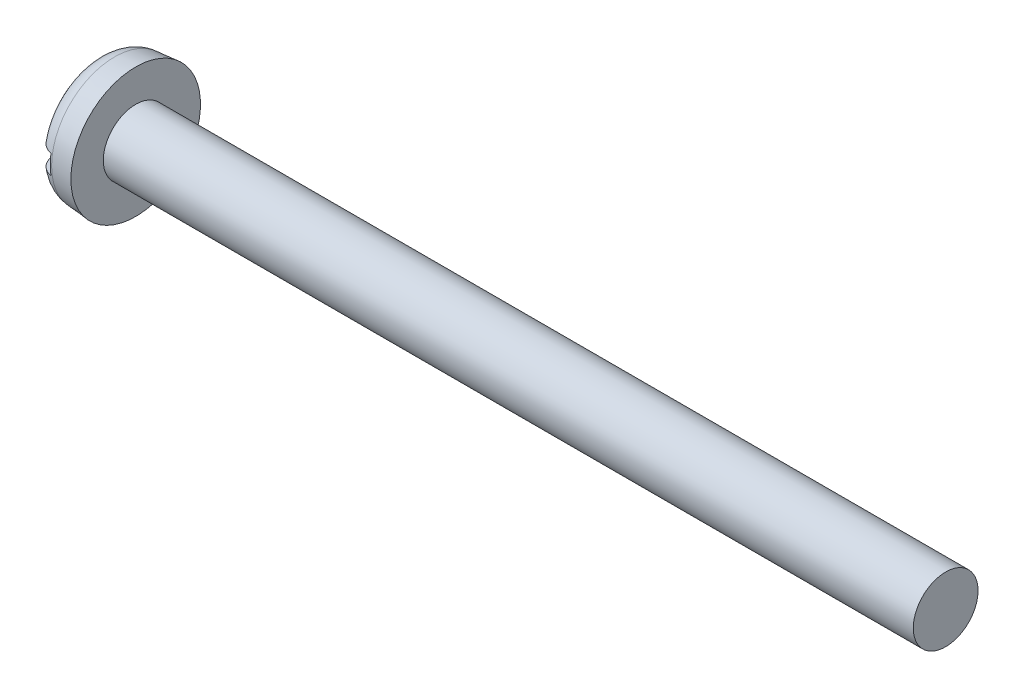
ISO-10303-21;
HEADER;
FILE_DESCRIPTION(('STEP AP214'),'2;1');
FILE_NAME('part.step','',(''),(''),'','','');
FILE_SCHEMA(('AUTOMOTIVE_DESIGN { 1 0 10303 214 1 1 1 1 }'));
ENDSEC;
DATA;
#1=APPLICATION_CONTEXT('core data for automotive mechanical design processes');
#2=APPLICATION_PROTOCOL_DEFINITION('international standard','automotive_design',2000,#1);
#3=PRODUCT_CONTEXT('',#1,'mechanical');
#4=PRODUCT('Part','Part','',(#3));
#5=PRODUCT_RELATED_PRODUCT_CATEGORY('part','',(#4));
#6=PRODUCT_DEFINITION_FORMATION('','',#4);
#7=PRODUCT_DEFINITION_CONTEXT('part definition',#1,'design');
#8=PRODUCT_DEFINITION('design','',#6,#7);
#9=PRODUCT_DEFINITION_SHAPE('','',#8);
#10=(LENGTH_UNIT() NAMED_UNIT(*) SI_UNIT(.MILLI.,.METRE.));
#11=(NAMED_UNIT(*) PLANE_ANGLE_UNIT() SI_UNIT($,.RADIAN.));
#12=(NAMED_UNIT(*) SI_UNIT($,.STERADIAN.) SOLID_ANGLE_UNIT());
#13=UNCERTAINTY_MEASURE_WITH_UNIT(LENGTH_MEASURE(1.E-05),#10,'distance_accuracy_value','');
#14=(GEOMETRIC_REPRESENTATION_CONTEXT(3) GLOBAL_UNCERTAINTY_ASSIGNED_CONTEXT((#13)) GLOBAL_UNIT_ASSIGNED_CONTEXT((#10,
#11,#12)) REPRESENTATION_CONTEXT('',''));
#15=CARTESIAN_POINT('',(0.,0.,0.));
#16=DIRECTION('',(0.,0.,1.));
#17=DIRECTION('',(1.,0.,0.));
#18=AXIS2_PLACEMENT_3D('',#15,#16,#17);
#19=CARTESIAN_POINT('',(0.,0.,0.));
#20=DIRECTION('',(-1.,0.,0.));
#21=DIRECTION('',(0.,0.,1.));
#22=AXIS2_PLACEMENT_3D('',#19,#20,#21);
#23=PLANE('',#22);
#24=DIRECTION('',(0.,0.,-1.));
#25=VECTOR('',#24,1.);
#26=CARTESIAN_POINT('',(0.,0.599999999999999,4.));
#27=LINE('',#26,#25);
#28=CARTESIAN_POINT('',(0.,0.599999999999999,2.62267277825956));
#29=VERTEX_POINT('',#28);
#30=CARTESIAN_POINT('',(0.,0.599999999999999,-2.62267277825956));
#31=VERTEX_POINT('',#30);
#32=EDGE_CURVE('E90',#29,#31,#27,.T.);
#33=ORIENTED_EDGE('',*,*,#32,.F.);
#34=CARTESIAN_POINT('',(0.,0.,0.));
#35=DIRECTION('',(-1.,0.,0.));
#36=DIRECTION('',(0.,0.,1.));
#37=AXIS2_PLACEMENT_3D('',#34,#35,#36);
#38=CIRCLE('',#37,2.69042979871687);
#39=EDGE_CURVE('E96',#29,#31,#38,.T.);
#40=ORIENTED_EDGE('',*,*,#39,.T.);
#41=EDGE_LOOP('',(#33,#40));
#42=FACE_BOUND('',#41,.T.);
#43=ADVANCED_FACE('F37',(#42),#23,.T.);
#44=CARTESIAN_POINT('',(-25.4,0.,0.));
#45=DIRECTION('',(-1.,0.,0.));
#46=DIRECTION('',(0.,0.,1.));
#47=AXIS2_PLACEMENT_3D('',#44,#45,#46);
#48=CYLINDRICAL_SURFACE('',#47,2.);
#49=CARTESIAN_POINT('',(52.4,0.,0.));
#50=DIRECTION('',(-1.,0.,0.));
#51=DIRECTION('',(0.,0.,1.));
#52=AXIS2_PLACEMENT_3D('',#49,#50,#51);
#53=CIRCLE('',#52,2.);
#54=CARTESIAN_POINT('',(52.4,0.,2.));
#55=VERTEX_POINT('',#54);
#56=EDGE_CURVE('E97',#55,#55,#53,.T.);
#57=ORIENTED_EDGE('',*,*,#56,.T.);
#58=EDGE_LOOP('',(#57));
#59=FACE_BOUND('',#58,.T.);
#60=CARTESIAN_POINT('',(2.4,0.,0.));
#61=DIRECTION('',(-1.,0.,0.));
#62=DIRECTION('',(0.,0.,1.));
#63=AXIS2_PLACEMENT_3D('',#60,#61,#62);
#64=CIRCLE('',#63,2.);
#65=CARTESIAN_POINT('',(2.4,0.,2.));
#66=VERTEX_POINT('',#65);
#67=EDGE_CURVE('E154',#66,#66,#64,.T.);
#68=ORIENTED_EDGE('',*,*,#67,.F.);
#69=EDGE_LOOP('',(#68));
#70=FACE_BOUND('',#69,.T.);
#71=ADVANCED_FACE('F142',(#59,#70),#48,.T.);
#72=CARTESIAN_POINT('',(52.4,2.,0.));
#73=DIRECTION('',(1.,0.,0.));
#74=DIRECTION('',(0.,0.,-1.));
#75=AXIS2_PLACEMENT_3D('',#72,#73,#74);
#76=PLANE('',#75);
#77=ORIENTED_EDGE('',*,*,#56,.F.);
#78=EDGE_LOOP('',(#77));
#79=FACE_BOUND('',#78,.T.);
#80=ADVANCED_FACE('F140',(#79),#76,.T.);
#81=DIRECTION('',(0.,0.,1.));
#82=VECTOR('',#81,1.);
#83=CARTESIAN_POINT('',(0.,-0.599999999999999,-4.));
#84=LINE('',#83,#82);
#85=CARTESIAN_POINT('',(0.,-0.6,-2.62267277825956));
#86=VERTEX_POINT('',#85);
#87=CARTESIAN_POINT('',(0.,-0.6,2.62267277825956));
#88=VERTEX_POINT('',#87);
#89=EDGE_CURVE('E81',#86,#88,#84,.T.);
#90=ORIENTED_EDGE('',*,*,#89,.F.);
#91=EDGE_CURVE('E88',#86,#88,#38,.T.);
#92=ORIENTED_EDGE('',*,*,#91,.T.);
#93=EDGE_LOOP('',(#90,#92));
#94=FACE_BOUND('',#93,.T.);
#95=ADVANCED_FACE('F87',(#94),#23,.T.);
#96=CARTESIAN_POINT('',(0.,0.,0.));
#97=DIRECTION('',(1.,0.,0.));
#98=DIRECTION('',(0.,0.,-1.));
#99=AXIS2_PLACEMENT_3D('',#96,#97,#98);
#100=CONICAL_SURFACE('',#99,3.79002720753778,0.0872664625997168);
#101=CARTESIAN_POINT('',(1.09541310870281,0.,0.));
#102=DIRECTION('',(-1.,0.,0.));
#103=DIRECTION('',(0.,0.,1.));
#104=AXIS2_PLACEMENT_3D('',#101,#102,#103);
#105=CIRCLE('',#104,3.88586343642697);
#106=CARTESIAN_POINT('',(1.09541310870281,0.,3.88586343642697));
#107=VERTEX_POINT('',#106);
#108=EDGE_CURVE('E100',#107,#107,#105,.F.);
#109=ORIENTED_EDGE('',*,*,#108,.T.);
#110=EDGE_LOOP('',(#109));
#111=FACE_BOUND('',#110,.T.);
#112=CARTESIAN_POINT('',(2.4,0.,0.));
#113=DIRECTION('',(-1.,0.,0.));
#114=DIRECTION('',(0.,0.,1.));
#115=AXIS2_PLACEMENT_3D('',#112,#113,#114);
#116=CIRCLE('',#115,4.);
#117=CARTESIAN_POINT('',(2.4,0.,4.));
#118=VERTEX_POINT('',#117);
#119=EDGE_CURVE('E102',#118,#118,#116,.T.);
#120=ORIENTED_EDGE('',*,*,#119,.T.);
#121=EDGE_LOOP('',(#120));
#122=FACE_BOUND('',#121,.T.);
#123=ADVANCED_FACE('F133',(#111,#122),#100,.T.);
#124=CARTESIAN_POINT('',(2.4,2.,0.));
#125=DIRECTION('',(-1.,0.,0.));
#126=DIRECTION('',(0.,0.,1.));
#127=AXIS2_PLACEMENT_3D('',#124,#125,#126);
#128=PLANE('',#127);
#129=ORIENTED_EDGE('',*,*,#119,.F.);
#130=EDGE_LOOP('',(#129));
#131=FACE_BOUND('',#130,.T.);
#132=ORIENTED_EDGE('',*,*,#67,.T.);
#133=EDGE_LOOP('',(#132));
#134=FACE_BOUND('',#133,.T.);
#135=ADVANCED_FACE('F129',(#131,#134),#128,.F.);
#136=CARTESIAN_POINT('',(1.2,0.,0.));
#137=DIRECTION('',(-1.,0.,0.));
#138=DIRECTION('',(0.,0.,1.));
#139=AXIS2_PLACEMENT_3D('',#136,#137,#138);
#140=TOROIDAL_SURFACE('',#139,2.69042979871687,1.2);
#141=CARTESIAN_POINT('',(0.555724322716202,0.599999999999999,-3.65387250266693));
#142=CARTESIAN_POINT('',(0.611863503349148,0.599999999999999,-3.69007442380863));
#143=CARTESIAN_POINT('',(0.671083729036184,0.599999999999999,-3.72158508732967));
#144=CARTESIAN_POINT('',(0.79401889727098,0.599999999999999,-3.77425118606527));
#145=CARTESIAN_POINT('',(0.85773880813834,0.599999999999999,-3.79539496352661));
#146=CARTESIAN_POINT('',(0.98781720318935,0.599999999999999,-3.82665867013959));
#147=CARTESIAN_POINT('',(1.05417498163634,0.599999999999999,-3.83678152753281));
#148=CARTESIAN_POINT('',(1.18763076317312,0.599999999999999,-3.8457038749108));
#149=CARTESIAN_POINT('',(1.25472858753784,0.599999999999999,-3.84450604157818));
#150=CARTESIAN_POINT('',(1.3875826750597,0.599999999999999,-3.83084960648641));
#151=CARTESIAN_POINT('',(1.45334209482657,0.599999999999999,-3.81842168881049));
#152=CARTESIAN_POINT('',(1.58184721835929,0.599999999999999,-3.78271705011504));
#153=CARTESIAN_POINT('',(1.64459283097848,0.599999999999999,-3.75944000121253));
#154=CARTESIAN_POINT('',(1.76539749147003,0.599999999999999,-3.70268381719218));
#155=CARTESIAN_POINT('',(1.82344949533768,0.599999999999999,-3.66918969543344));
#156=CARTESIAN_POINT('',(1.93315741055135,0.599999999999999,-3.59299631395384));
#157=CARTESIAN_POINT('',(1.98481318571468,0.599999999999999,-3.55029685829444));
#158=CARTESIAN_POINT('',(2.08067865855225,0.599999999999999,-3.45659366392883));
#159=CARTESIAN_POINT('',(2.12483195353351,0.599999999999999,-3.40553224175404));
#160=CARTESIAN_POINT('',(2.20406927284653,0.599999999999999,-3.2968041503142));
#161=CARTESIAN_POINT('',(2.23915285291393,0.599999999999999,-3.23913715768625));
#162=CARTESIAN_POINT('',(2.29977245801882,0.599999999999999,-3.11803251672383));
#163=CARTESIAN_POINT('',(2.32517621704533,0.599999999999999,-3.0545286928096));
#164=CARTESIAN_POINT('',(2.36518290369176,0.599999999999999,-2.92420898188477));
#165=CARTESIAN_POINT('',(2.37978492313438,0.599999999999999,-2.85739281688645));
#166=CARTESIAN_POINT('',(2.39809162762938,0.599999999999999,-2.720979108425));
#167=CARTESIAN_POINT('',(2.40158167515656,0.599999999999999,-2.65135279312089));
#168=CARTESIAN_POINT('',(2.39710334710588,0.599999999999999,-2.51247199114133));
#169=CARTESIAN_POINT('',(2.3891336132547,0.599999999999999,-2.44321754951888));
#170=CARTESIAN_POINT('',(2.36175648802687,0.599999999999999,-2.30533307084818));
#171=CARTESIAN_POINT('',(2.34208762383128,0.599999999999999,-2.23675493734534));
#172=CARTESIAN_POINT('',(2.29173579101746,0.599999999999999,-2.10376468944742));
#173=CARTESIAN_POINT('',(2.26105116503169,0.599999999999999,-2.03935320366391));
#174=CARTESIAN_POINT('',(2.18883893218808,0.599999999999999,-1.91526992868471));
#175=CARTESIAN_POINT('',(2.1471165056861,0.599999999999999,-1.85571135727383));
#176=CARTESIAN_POINT('',(2.05420440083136,0.599999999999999,-1.74447273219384));
#177=CARTESIAN_POINT('',(2.00301317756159,0.599999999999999,-1.69279396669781));
#178=CARTESIAN_POINT('',(1.89282670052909,0.599999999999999,-1.59935956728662));
#179=CARTESIAN_POINT('',(1.83388602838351,0.599999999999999,-1.55753977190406));
#180=CARTESIAN_POINT('',(1.70948185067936,0.599999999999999,-1.48508690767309));
#181=CARTESIAN_POINT('',(1.64402152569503,0.599999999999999,-1.45444841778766));
#182=CARTESIAN_POINT('',(1.51242704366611,0.599999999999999,-1.40732654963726));
#183=CARTESIAN_POINT('',(1.44654962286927,0.599999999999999,-1.39012852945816));
#184=CARTESIAN_POINT('',(1.31277581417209,0.599999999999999,-1.36804629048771));
#185=CARTESIAN_POINT('',(1.24488075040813,0.599999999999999,-1.36315416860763));
#186=CARTESIAN_POINT('',(1.11440042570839,0.599999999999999,-1.3658663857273));
#187=CARTESIAN_POINT('',(1.05179449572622,0.599999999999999,-1.37257162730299));
#188=CARTESIAN_POINT('',(0.928605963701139,0.599999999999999,-1.39641067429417));
#189=CARTESIAN_POINT('',(0.868023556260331,0.599999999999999,-1.41354547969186));
#190=CARTESIAN_POINT('',(0.750454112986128,0.599999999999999,-1.45742791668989));
#191=CARTESIAN_POINT('',(0.693467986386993,0.599999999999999,-1.48417796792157));
#192=CARTESIAN_POINT('',(0.584374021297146,0.599999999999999,-1.54623887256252));
#193=CARTESIAN_POINT('',(0.532267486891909,0.599999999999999,-1.58155200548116));
#194=CARTESIAN_POINT('',(0.430463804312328,0.599999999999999,-1.66242118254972));
#195=CARTESIAN_POINT('',(0.381204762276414,0.599999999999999,-1.70852877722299));
#196=CARTESIAN_POINT('',(0.29055833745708,0.599999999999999,-1.80792441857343));
#197=CARTESIAN_POINT('',(0.249173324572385,0.599999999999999,-1.8612146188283));
#198=CARTESIAN_POINT('',(0.172904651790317,0.599999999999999,-1.97708145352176));
#199=CARTESIAN_POINT('',(0.138582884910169,0.599999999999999,-2.04002893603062));
#200=CARTESIAN_POINT('',(0.080798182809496,0.599999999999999,-2.1707301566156));
#201=CARTESIAN_POINT('',(0.0573365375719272,0.599999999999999,-2.23848446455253));
#202=CARTESIAN_POINT('',(0.0217170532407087,0.599999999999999,-2.37805490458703));
#203=CARTESIAN_POINT('',(0.0097436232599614,0.599999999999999,-2.44991829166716));
#204=CARTESIAN_POINT('',(-0.00176444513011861,0.599999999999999,-2.59463581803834));
#205=CARTESIAN_POINT('',(-0.00130029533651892,0.599999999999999,-2.66748986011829));
#206=CARTESIAN_POINT('',(0.0120986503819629,0.599999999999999,-2.81089700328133));
#207=CARTESIAN_POINT('',(0.0248384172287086,0.599999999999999,-2.88146827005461));
#208=CARTESIAN_POINT('',(0.0622829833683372,0.599999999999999,-3.01938616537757));
#209=CARTESIAN_POINT('',(0.0869893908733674,0.599999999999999,-3.08673235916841));
#210=CARTESIAN_POINT('',(0.147034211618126,0.599999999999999,-3.21458941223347));
#211=CARTESIAN_POINT('',(0.182112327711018,0.599999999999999,-3.27522270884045));
#212=CARTESIAN_POINT('',(0.262129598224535,0.599999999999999,-3.38951376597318));
#213=CARTESIAN_POINT('',(0.3070551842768,0.599999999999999,-3.4431809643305));
#214=CARTESIAN_POINT('',(0.386487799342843,0.599999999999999,-3.52288800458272));
#215=CARTESIAN_POINT('',(0.41834969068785,0.599999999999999,-3.55161115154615));
#216=CARTESIAN_POINT('',(0.484959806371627,0.599999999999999,-3.60549063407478));
#217=CARTESIAN_POINT('',(0.519707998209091,0.599999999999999,-3.63064700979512));
#218=CARTESIAN_POINT('',(0.555724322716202,0.599999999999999,-3.65387250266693));
#219=B_SPLINE_CURVE_WITH_KNOTS('',3,(#141,#142,#143,#144,#145,#146,#147,#148,#149,#150,#151,
#152,#153,#154,#155,#156,#157,#158,#159,#160,#161,#162,#163,#164,#165,#166,#167,#168,#169,#170,
#171,#172,#173,#174,#175,#176,#177,#178,#179,#180,#181,#182,#183,#184,#185,#186,#187,#188,#189,
#190,#191,#192,#193,#194,#195,#196,#197,#198,#199,#200,#201,#202,#203,#204,#205,#206,#207,#208,
#209,#210,#211,#212,#213,#214,#215,#216,#217,#218),.UNSPECIFIED.,.T.,.F.,(4,2,2,2,2,2,2,2,2,2,2,
2,2,2,2,2,2,2,2,2,2,2,2,2,2,2,2,2,2,2,2,2,2,2,2,2,2,2,4),(0.,0.200243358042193,
0.400711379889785,0.601126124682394,0.801493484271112,1.00131502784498,1.20114261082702,
1.40126472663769,1.60139110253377,1.80296115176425,2.0045410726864,2.20878426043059,
2.4130446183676,2.62122723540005,2.82943452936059,3.04247992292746,3.25555738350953,
3.47268067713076,3.68983942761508,3.90554330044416,4.12114245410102,4.32430364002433,
4.52733431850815,4.71532091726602,4.90332554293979,5.09137751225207,5.27947959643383,
5.48102054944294,5.68262206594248,5.89671811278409,6.11083958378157,6.3283433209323,
6.54582586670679,6.75990916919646,6.97402125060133,7.18315981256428,7.39201200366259,
7.52048040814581,7.64894736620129),.UNSPECIFIED.);
#220=CARTESIAN_POINT('',(1.,0.599999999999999,-3.8268957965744));
#221=VERTEX_POINT('',#220);
#222=EDGE_CURVE('E11',#31,#221,#219,.T.);
#223=ORIENTED_EDGE('',*,*,#222,.F.);
#224=ORIENTED_EDGE('',*,*,#39,.F.);
#225=CARTESIAN_POINT('',(0.502169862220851,0.599999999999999,1.60576049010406));
#226=CARTESIAN_POINT('',(0.554195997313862,0.599999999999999,1.56606149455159));
#227=CARTESIAN_POINT('',(0.609396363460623,0.599999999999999,1.5304748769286));
#228=CARTESIAN_POINT('',(0.724919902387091,0.599999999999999,1.46881203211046));
#229=CARTESIAN_POINT('',(0.78524511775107,0.599999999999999,1.44273961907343));
#230=CARTESIAN_POINT('',(0.909667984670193,0.599999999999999,1.40122623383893));
#231=CARTESIAN_POINT('',(0.973775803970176,0.599999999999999,1.3858154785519));
#232=CARTESIAN_POINT('',(1.10369459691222,0.599999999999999,1.3665995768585));
#233=CARTESIAN_POINT('',(1.16950473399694,0.599999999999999,1.36278883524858));
#234=CARTESIAN_POINT('',(1.29767383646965,0.599999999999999,1.36688511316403));
#235=CARTESIAN_POINT('',(1.36005075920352,0.599999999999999,1.37425454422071));
#236=CARTESIAN_POINT('',(1.48268610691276,0.599999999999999,1.3993323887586));
#237=CARTESIAN_POINT('',(1.54294419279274,0.599999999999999,1.41704244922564));
#238=CARTESIAN_POINT('',(1.66002557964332,0.599999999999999,1.46205841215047));
#239=CARTESIAN_POINT('',(1.7168336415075,0.599999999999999,1.48940370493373));
#240=CARTESIAN_POINT('',(1.82548566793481,0.599999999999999,1.55261257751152));
#241=CARTESIAN_POINT('',(1.87732830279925,0.599999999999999,1.58847843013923));
#242=CARTESIAN_POINT('',(1.97854810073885,0.599999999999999,1.67047725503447));
#243=CARTESIAN_POINT('',(2.02747577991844,0.599999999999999,1.71716517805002));
#244=CARTESIAN_POINT('',(2.11736172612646,0.599999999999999,1.81767012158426));
#245=CARTESIAN_POINT('',(2.15831764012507,0.599999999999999,1.87148923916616));
#246=CARTESIAN_POINT('',(2.23355847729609,0.599999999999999,1.98831219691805));
#247=CARTESIAN_POINT('',(2.26728695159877,0.599999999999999,2.05167539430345));
#248=CARTESIAN_POINT('',(2.32380864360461,0.599999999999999,2.18310973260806));
#249=CARTESIAN_POINT('',(2.34660064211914,0.599999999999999,2.25118139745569));
#250=CARTESIAN_POINT('',(2.38078258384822,0.599999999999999,2.39118439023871));
#251=CARTESIAN_POINT('',(2.39200303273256,0.599999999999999,2.4631572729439));
#252=CARTESIAN_POINT('',(2.40199059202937,0.599999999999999,2.6079662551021));
#253=CARTESIAN_POINT('',(2.40075847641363,0.599999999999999,2.68080230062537));
#254=CARTESIAN_POINT('',(2.38584508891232,0.599999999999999,2.82400920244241));
#255=CARTESIAN_POINT('',(2.37236420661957,0.599999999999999,2.89440086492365));
#256=CARTESIAN_POINT('',(2.33348423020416,0.599999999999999,3.03181492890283));
#257=CARTESIAN_POINT('',(2.30808661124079,0.599999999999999,3.09883774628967));
#258=CARTESIAN_POINT('',(2.24675302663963,0.599999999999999,3.22591541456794));
#259=CARTESIAN_POINT('',(2.21108136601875,0.599999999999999,3.28609785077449));
#260=CARTESIAN_POINT('',(2.12994290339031,0.599999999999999,3.39945330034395));
#261=CARTESIAN_POINT('',(2.08447722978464,0.599999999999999,3.45262712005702));
#262=CARTESIAN_POINT('',(1.98604906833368,0.599999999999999,3.54932660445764));
#263=CARTESIAN_POINT('',(1.93325708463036,0.599999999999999,3.59302587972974));
#264=CARTESIAN_POINT('',(1.82099888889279,0.599999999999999,3.6707908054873));
#265=CARTESIAN_POINT('',(1.76153323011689,0.599999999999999,3.70485725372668));
#266=CARTESIAN_POINT('',(1.63851582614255,0.599999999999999,3.76190993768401));
#267=CARTESIAN_POINT('',(1.575032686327,0.599999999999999,3.78504416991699));
#268=CARTESIAN_POINT('',(1.44506693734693,0.599999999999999,3.82023372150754));
#269=CARTESIAN_POINT('',(1.37858447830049,0.599999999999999,3.83228959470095));
#270=CARTESIAN_POINT('',(1.2450532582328,0.599999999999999,3.84490952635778));
#271=CARTESIAN_POINT('',(1.17801273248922,0.599999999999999,3.84556087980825));
#272=CARTESIAN_POINT('',(1.04477855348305,0.599999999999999,3.83557645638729));
#273=CARTESIAN_POINT('',(0.97858488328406,0.599999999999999,3.82494090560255));
#274=CARTESIAN_POINT('',(0.849043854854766,0.599999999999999,3.79272986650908));
#275=CARTESIAN_POINT('',(0.785691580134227,0.599999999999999,3.77117413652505));
#276=CARTESIAN_POINT('',(0.663485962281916,0.599999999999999,3.71777208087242));
#277=CARTESIAN_POINT('',(0.604632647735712,0.599999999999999,3.68592568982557));
#278=CARTESIAN_POINT('',(0.492838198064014,0.599999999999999,3.61273559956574));
#279=CARTESIAN_POINT('',(0.439920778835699,0.599999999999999,3.57135568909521));
#280=CARTESIAN_POINT('',(0.341703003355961,0.599999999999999,3.48037671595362));
#281=CARTESIAN_POINT('',(0.296402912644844,0.599999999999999,3.4307773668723));
#282=CARTESIAN_POINT('',(0.214216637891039,0.599999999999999,3.32426975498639));
#283=CARTESIAN_POINT('',(0.177416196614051,0.599999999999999,3.26729535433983));
#284=CARTESIAN_POINT('',(0.113734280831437,0.599999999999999,3.14805291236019));
#285=CARTESIAN_POINT('',(0.0868534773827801,0.599999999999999,3.08578451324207));
#286=CARTESIAN_POINT('',(0.0432984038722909,0.599999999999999,2.95667993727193));
#287=CARTESIAN_POINT('',(0.0267920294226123,0.599999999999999,2.88978715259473));
#288=CARTESIAN_POINT('',(0.0049909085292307,0.599999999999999,2.75420476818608));
#289=CARTESIAN_POINT('',(-0.00030316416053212,0.599999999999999,2.68551506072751));
#290=CARTESIAN_POINT('',(0.000336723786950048,0.599999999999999,2.54672879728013));
#291=CARTESIAN_POINT('',(0.00651181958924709,0.599999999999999,2.47663338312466));
#292=CARTESIAN_POINT('',(0.0302683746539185,0.599999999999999,2.33838698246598));
#293=CARTESIAN_POINT('',(0.0478537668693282,0.599999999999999,2.27023667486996));
#294=CARTESIAN_POINT('',(0.0944025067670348,0.599999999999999,2.13614591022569));
#295=CARTESIAN_POINT('',(0.123623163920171,0.599999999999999,2.07029483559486));
#296=CARTESIAN_POINT('',(0.192559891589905,0.599999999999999,1.94438410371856));
#297=CARTESIAN_POINT('',(0.2322674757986,0.599999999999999,1.88431981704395));
#298=CARTESIAN_POINT('',(0.309450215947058,0.599999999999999,1.78645693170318));
#299=CARTESIAN_POINT('',(0.344782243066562,0.599999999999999,1.74694893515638));
#300=CARTESIAN_POINT('',(0.420107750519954,0.599999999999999,1.67265127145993));
#301=CARTESIAN_POINT('',(0.460101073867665,0.599999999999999,1.63786144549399));
#302=CARTESIAN_POINT('',(0.502169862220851,0.599999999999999,1.60576049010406));
#303=B_SPLINE_CURVE_WITH_KNOTS('',3,(#225,#226,#227,#228,#229,#230,#231,#232,#233,#234,#235,
#236,#237,#238,#239,#240,#241,#242,#243,#244,#245,#246,#247,#248,#249,#250,#251,#252,#253,#254,
#255,#256,#257,#258,#259,#260,#261,#262,#263,#264,#265,#266,#267,#268,#269,#270,#271,#272,#273,
#274,#275,#276,#277,#278,#279,#280,#281,#282,#283,#284,#285,#286,#287,#288,#289,#290,#291,#292,
#293,#294,#295,#296,#297,#298,#299,#300,#301,#302),.UNSPECIFIED.,.T.,.F.,(4,2,2,2,2,2,2,2,2,2,2,
2,2,2,2,2,2,2,2,2,2,2,2,2,2,2,2,2,2,2,2,2,2,2,2,2,2,2,4),(0.,0.196155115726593,
0.392388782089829,0.589176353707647,0.785868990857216,0.973398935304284,1.16095875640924,
1.34929442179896,1.53768038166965,1.73969106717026,1.94176129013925,2.15610790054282,
2.37047840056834,2.58794612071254,2.80540032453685,3.01935980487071,3.23329280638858,
3.44215048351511,3.65098411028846,3.85558774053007,4.06017442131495,4.26190596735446,
4.4636274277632,4.66380414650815,4.86397685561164,5.06378867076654,5.26360175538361,
5.46418668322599,5.66477860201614,5.8673133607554,6.0698618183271,6.27560910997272,
6.48136876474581,6.69150348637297,6.90171067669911,7.11685054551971,7.3318168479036,
7.4904349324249,7.64904767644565),.UNSPECIFIED.);
#304=CARTESIAN_POINT('',(1.,0.599999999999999,3.8268957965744));
#305=VERTEX_POINT('',#304);
#306=EDGE_CURVE('E114',#305,#29,#303,.T.);
#307=ORIENTED_EDGE('',*,*,#306,.F.);
#308=CARTESIAN_POINT('',(1.,0.,0.));
#309=DIRECTION('',(-1.,0.,0.));
#310=DIRECTION('',(0.,0.,1.));
#311=AXIS2_PLACEMENT_3D('',#308,#309,#310);
#312=CIRCLE('',#311,3.8736457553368);
#313=CARTESIAN_POINT('',(1.,-0.600000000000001,3.8268957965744));
#314=VERTEX_POINT('',#313);
#315=EDGE_CURVE('E108',#305,#314,#312,.F.);
#316=ORIENTED_EDGE('',*,*,#315,.T.);
#317=CARTESIAN_POINT('',(0.502169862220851,-0.6,1.60576049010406));
#318=CARTESIAN_POINT('',(0.445187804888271,-0.6,1.64924594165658));
#319=CARTESIAN_POINT('',(0.391933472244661,-0.6,1.69773094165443));
#320=CARTESIAN_POINT('',(0.294269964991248,-0.6,1.80302002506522));
#321=CARTESIAN_POINT('',(0.249878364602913,-0.6,1.85984025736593));
#322=CARTESIAN_POINT('',(0.171206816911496,-0.6,1.97997650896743));
#323=CARTESIAN_POINT('',(0.136911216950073,-0.6,2.04328226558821));
#324=CARTESIAN_POINT('',(0.079302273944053,-0.6,2.17467115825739));
#325=CARTESIAN_POINT('',(0.0559837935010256,-0.6,2.24275204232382));
#326=CARTESIAN_POINT('',(0.0208174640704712,-0.6,2.38269571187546));
#327=CARTESIAN_POINT('',(0.00911087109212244,-0.6,2.45459412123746));
#328=CARTESIAN_POINT('',(-0.00186064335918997,-0.6,2.59934603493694));
#329=CARTESIAN_POINT('',(-0.00112505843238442,-0.6,2.67219957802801));
#330=CARTESIAN_POINT('',(0.0128115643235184,-0.6,2.81554909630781));
#331=CARTESIAN_POINT('',(0.0258159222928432,-0.6,2.88606413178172));
#332=CARTESIAN_POINT('',(0.063770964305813,-0.6,3.02380438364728));
#333=CARTESIAN_POINT('',(0.0887200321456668,-0.6,3.09103004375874));
#334=CARTESIAN_POINT('',(0.149209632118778,-0.6,3.21858311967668));
#335=CARTESIAN_POINT('',(0.184484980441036,-0.6,3.279036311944));
#336=CARTESIAN_POINT('',(0.264884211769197,-0.6,3.39299625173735));
#337=CARTESIAN_POINT('',(0.310006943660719,-0.6,3.44650381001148));
#338=CARTESIAN_POINT('',(0.407814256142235,-0.6,3.54391044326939));
#339=CARTESIAN_POINT('',(0.460326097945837,-0.600000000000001,3.58798302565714));
#340=CARTESIAN_POINT('',(0.572092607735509,-0.600000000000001,3.66653552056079));
#341=CARTESIAN_POINT('',(0.631346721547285,-0.600000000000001,3.70101622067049));
#342=CARTESIAN_POINT('',(0.754010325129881,-0.600000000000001,3.75891555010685));
#343=CARTESIAN_POINT('',(0.817349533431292,-0.600000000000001,3.78248314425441));
#344=CARTESIAN_POINT('',(0.947103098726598,-0.600000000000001,3.8185560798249));
#345=CARTESIAN_POINT('',(1.01351729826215,-0.600000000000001,3.831061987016));
#346=CARTESIAN_POINT('',(1.14698149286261,-0.600000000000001,3.84458065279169));
#347=CARTESIAN_POINT('',(1.21402252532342,-0.600000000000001,3.84568204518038));
#348=CARTESIAN_POINT('',(1.34733322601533,-0.600000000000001,3.8365898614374));
#349=CARTESIAN_POINT('',(1.41360291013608,-0.600000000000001,3.82639651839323));
#350=CARTESIAN_POINT('',(1.54336099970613,-0.600000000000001,3.79504996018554));
#351=CARTESIAN_POINT('',(1.60685449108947,-0.600000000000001,3.77391778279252));
#352=CARTESIAN_POINT('',(1.72941080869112,-0.600000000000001,3.72133205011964));
#353=CARTESIAN_POINT('',(1.78847360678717,-0.600000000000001,3.68987842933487));
#354=CARTESIAN_POINT('',(1.90074291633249,-0.600000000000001,3.61743745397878));
#355=CARTESIAN_POINT('',(1.95392663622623,-0.6,3.57641479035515));
#356=CARTESIAN_POINT('',(2.05273165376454,-0.6,3.48610012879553));
#357=CARTESIAN_POINT('',(2.09835269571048,-0.6,3.43680785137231));
#358=CARTESIAN_POINT('',(2.18122399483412,-0.6,3.33086486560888));
#359=CARTESIAN_POINT('',(2.21838996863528,-0.6,3.27414825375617));
#360=CARTESIAN_POINT('',(2.28283903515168,-0.6,3.15535714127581));
#361=CARTESIAN_POINT('',(2.31012151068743,-0.6,3.09328230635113));
#362=CARTESIAN_POINT('',(2.35450773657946,-0.6,2.9645074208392));
#363=CARTESIAN_POINT('',(2.37144545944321,-0.6,2.89775017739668));
#364=CARTESIAN_POINT('',(2.39412527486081,-0.6,2.76236351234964));
#365=CARTESIAN_POINT('',(2.39986625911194,-0.6,2.69373390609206));
#366=CARTESIAN_POINT('',(2.40013189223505,-0.6,2.55499487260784));
#367=CARTESIAN_POINT('',(2.39441545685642,-0.6,2.48488500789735));
#368=CARTESIAN_POINT('',(2.37157048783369,-0.6,2.34655110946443));
#369=CARTESIAN_POINT('',(2.35444050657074,-0.6,2.27832731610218));
#370=CARTESIAN_POINT('',(2.30880229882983,-0.6,2.14403189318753));
#371=CARTESIAN_POINT('',(2.28004015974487,-0.6,2.07804649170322));
#372=CARTESIAN_POINT('',(2.21198205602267,-0.6,1.95173941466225));
#373=CARTESIAN_POINT('',(2.17268418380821,-0.6,1.89141876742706));
#374=CARTESIAN_POINT('',(2.08404278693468,-0.6,1.77746904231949));
#375=CARTESIAN_POINT('',(2.03458266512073,-0.6,1.72393048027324));
#376=CARTESIAN_POINT('',(1.92716812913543,-0.6,1.62615004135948));
#377=CARTESIAN_POINT('',(1.86921365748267,-0.6,1.58190822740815));
#378=CARTESIAN_POINT('',(1.74788146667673,-0.6,1.50544361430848));
#379=CARTESIAN_POINT('',(1.68467867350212,-0.6,1.47294432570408));
#380=CARTESIAN_POINT('',(1.55342236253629,-0.6,1.41999907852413));
#381=CARTESIAN_POINT('',(1.48537275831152,-0.6,1.399543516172));
#382=CARTESIAN_POINT('',(1.35177681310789,-0.6,1.37290195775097));
#383=CARTESIAN_POINT('',(1.28641871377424,-0.6,1.36577077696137));
#384=CARTESIAN_POINT('',(1.15546768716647,-0.6,1.36327728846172));
#385=CARTESIAN_POINT('',(1.0898747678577,-0.6,1.36791458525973));
#386=CARTESIAN_POINT('',(0.963980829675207,-0.6,1.38812170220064));
#387=CARTESIAN_POINT('',(0.903583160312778,-0.6,1.40310206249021));
#388=CARTESIAN_POINT('',(0.786066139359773,-0.6,1.44262683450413));
#389=CARTESIAN_POINT('',(0.728943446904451,-0.6,1.46716129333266));
#390=CARTESIAN_POINT('',(0.64397073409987,-0.6,1.51179271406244));
#391=CARTESIAN_POINT('',(0.614516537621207,-0.6,1.5289173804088));
#392=CARTESIAN_POINT('',(0.557151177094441,-0.6,1.56557223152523));
#393=CARTESIAN_POINT('',(0.529239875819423,-0.6,1.58510220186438));
#394=CARTESIAN_POINT('',(0.502169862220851,-0.6,1.60576049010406));
#395=B_SPLINE_CURVE_WITH_KNOTS('',3,(#317,#318,#319,#320,#321,#322,#323,#324,#325,#326,#327,
#328,#329,#330,#331,#332,#333,#334,#335,#336,#337,#338,#339,#340,#341,#342,#343,#344,#345,#346,
#347,#348,#349,#350,#351,#352,#353,#354,#355,#356,#357,#358,#359,#360,#361,#362,#363,#364,#365,
#366,#367,#368,#369,#370,#371,#372,#373,#374,#375,#376,#377,#378,#379,#380,#381,#382,#383,#384,
#385,#386,#387,#388,#389,#390,#391,#392,#393,#394),.UNSPECIFIED.,.T.,.F.,(4,2,2,2,2,2,2,2,2,2,2,
2,2,2,2,2,2,2,2,2,2,2,2,2,2,2,2,2,2,2,2,2,2,2,2,2,2,2,4),(0.,0.214909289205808,
0.430240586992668,0.645236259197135,0.860131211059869,1.07760937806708,1.29509639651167,
1.50915509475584,1.72318483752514,1.93213930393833,2.14106935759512,2.34574393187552,
2.55040169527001,2.75217693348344,2.95394185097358,3.15413750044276,3.35432901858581,
3.5541369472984,3.75394614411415,3.95450462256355,4.15506988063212,4.35755447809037,
4.56005171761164,4.76571892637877,4.97140649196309,5.1814675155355,5.39155518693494,
5.60650016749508,5.82148409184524,6.0390882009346,6.25669378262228,6.46877775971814,
6.68069238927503,6.87690174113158,7.07310449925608,7.25895986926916,7.44462214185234,
7.5467264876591,7.64882173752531),.UNSPECIFIED.);
#396=EDGE_CURVE('E95',#88,#314,#395,.T.);
#397=ORIENTED_EDGE('',*,*,#396,.F.);
#398=ORIENTED_EDGE('',*,*,#91,.F.);
#399=CARTESIAN_POINT('',(0.555724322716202,-0.599999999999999,-3.65387250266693));
#400=CARTESIAN_POINT('',(0.498734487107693,-0.599999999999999,-3.61711459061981));
#401=CARTESIAN_POINT('',(0.444834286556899,-0.6,-3.57546537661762));
#402=CARTESIAN_POINT('',(0.344782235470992,-0.6,-3.48363725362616));
#403=CARTESIAN_POINT('',(0.298641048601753,-0.6,-3.43344679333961));
#404=CARTESIAN_POINT('',(0.215461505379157,-0.6,-3.32610544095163));
#405=CARTESIAN_POINT('',(0.178413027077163,-0.6,-3.2689623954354));
#406=CARTESIAN_POINT('',(0.114320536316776,-0.6,-3.14934530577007));
#407=CARTESIAN_POINT('',(0.087273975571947,-0.6,-3.08687262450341));
#408=CARTESIAN_POINT('',(0.0435456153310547,-0.6,-2.95757076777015));
#409=CARTESIAN_POINT('',(0.0269912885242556,-0.6,-2.89069851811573));
#410=CARTESIAN_POINT('',(0.00508983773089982,-0.6,-2.75514352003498));
#411=CARTESIAN_POINT('',(-0.000255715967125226,-0.6,-2.68646051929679));
#412=CARTESIAN_POINT('',(0.000280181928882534,-0.6,-2.54767232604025));
#413=CARTESIAN_POINT('',(0.00640389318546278,-0.6,-2.47756809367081));
#414=CARTESIAN_POINT('',(0.030057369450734,-0.6,-2.33931217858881));
#415=CARTESIAN_POINT('',(0.0475885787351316,-0.6,-2.27116074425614));
#416=CARTESIAN_POINT('',(0.0940220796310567,-0.6,-2.13708014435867));
#417=CARTESIAN_POINT('',(0.123177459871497,-0.6,-2.07123856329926));
#418=CARTESIAN_POINT('',(0.191996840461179,-0.6,-1.94528477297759));
#419=CARTESIAN_POINT('',(0.23166272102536,-0.6,-1.88517359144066));
#420=CARTESIAN_POINT('',(0.320994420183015,-0.6,-1.77173274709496));
#421=CARTESIAN_POINT('',(0.370772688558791,-0.6,-1.71849145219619));
#422=CARTESIAN_POINT('',(0.478774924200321,-0.6,-1.62136628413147));
#423=CARTESIAN_POINT('',(0.53699882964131,-0.6,-1.57748234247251));
#424=CARTESIAN_POINT('',(0.658746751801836,-0.6,-1.50181934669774));
#425=CARTESIAN_POINT('',(0.722091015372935,-0.6,-1.46975218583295));
#426=CARTESIAN_POINT('',(0.85355413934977,-0.6,-1.41769610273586));
#427=CARTESIAN_POINT('',(0.9216693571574,-0.6,-1.39769807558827));
#428=CARTESIAN_POINT('',(1.05528073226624,-0.6,-1.37194849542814));
#429=CARTESIAN_POINT('',(1.12059402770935,-0.6,-1.36524668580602));
#430=CARTESIAN_POINT('',(1.2513608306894,-0.6,-1.36358106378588));
#431=CARTESIAN_POINT('',(1.31681429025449,-0.6,-1.36861372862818));
#432=CARTESIAN_POINT('',(1.44243637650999,-0.6,-1.3895462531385));
#433=CARTESIAN_POINT('',(1.50270294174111,-0.6,-1.40486826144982));
#434=CARTESIAN_POINT('',(1.61996472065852,-0.6,-1.44504162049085));
#435=CARTESIAN_POINT('',(1.67695924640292,-0.6,-1.46989496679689));
#436=CARTESIAN_POINT('',(1.78847236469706,-0.6,-1.52925603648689));
#437=CARTESIAN_POINT('',(1.8428136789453,-0.6,-1.56409575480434));
#438=CARTESIAN_POINT('',(1.94542643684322,-0.6,-1.64178505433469));
#439=CARTESIAN_POINT('',(1.99369605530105,-0.6,-1.68463703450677));
#440=CARTESIAN_POINT('',(2.08661844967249,-0.6,-1.78069023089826));
#441=CARTESIAN_POINT('',(2.13071333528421,-0.6,-1.83443193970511));
#442=CARTESIAN_POINT('',(2.20971293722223,-0.6,-1.94829602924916));
#443=CARTESIAN_POINT('',(2.24461542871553,-0.6,-2.00841994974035));
#444=CARTESIAN_POINT('',(2.30564498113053,-0.6,-2.13620099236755));
#445=CARTESIAN_POINT('',(2.33132647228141,-0.6,-2.20407160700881));
#446=CARTESIAN_POINT('',(2.37093013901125,-0.6,-2.34316607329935));
#447=CARTESIAN_POINT('',(2.38485194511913,-0.6,-2.41439003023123));
#448=CARTESIAN_POINT('',(2.40040871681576,-0.6,-2.55814530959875));
#449=CARTESIAN_POINT('',(2.4020489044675,-0.6,-2.63067606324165));
#450=CARTESIAN_POINT('',(2.39285255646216,-0.6,-2.77494594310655));
#451=CARTESIAN_POINT('',(2.38201725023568,-0.6,-2.84668514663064));
#452=CARTESIAN_POINT('',(2.34840555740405,-0.6,-2.98570551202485));
#453=CARTESIAN_POINT('',(2.32588655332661,-0.6,-3.05304886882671));
#454=CARTESIAN_POINT('',(2.26959715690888,-0.6,-3.18285922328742));
#455=CARTESIAN_POINT('',(2.23582815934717,-0.6,-3.24532682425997));
#456=CARTESIAN_POINT('',(2.15885364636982,-0.6,-3.3620818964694));
#457=CARTESIAN_POINT('',(2.11588409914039,-0.6,-3.41652497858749));
#458=CARTESIAN_POINT('',(2.02126247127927,-0.6,-3.51725700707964));
#459=CARTESIAN_POINT('',(1.96961127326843,-0.599999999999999,-3.56354678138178));
#460=CARTESIAN_POINT('',(1.86010105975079,-0.599999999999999,-3.64579800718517));
#461=CARTESIAN_POINT('',(1.80236971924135,-0.599999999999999,-3.68192950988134));
#462=CARTESIAN_POINT('',(1.681608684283,-0.599999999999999,-3.74385467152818));
#463=CARTESIAN_POINT('',(1.61857958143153,-0.599999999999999,-3.76964948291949));
#464=CARTESIAN_POINT('',(1.48979929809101,-0.599999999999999,-3.80988187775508));
#465=CARTESIAN_POINT('',(1.42408810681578,-0.599999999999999,-3.82444755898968));
#466=CARTESIAN_POINT('',(1.29113110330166,-0.599999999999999,-3.84227724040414));
#467=CARTESIAN_POINT('',(1.22388494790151,-0.599999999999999,-3.84553868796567));
#468=CARTESIAN_POINT('',(1.09014166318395,-0.599999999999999,-3.84067025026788));
#469=CARTESIAN_POINT('',(1.02364248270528,-0.599999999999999,-3.83259555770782));
#470=CARTESIAN_POINT('',(0.893005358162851,-0.599999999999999,-3.80539646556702));
#471=CARTESIAN_POINT('',(0.828864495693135,-0.599999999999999,-3.78628624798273));
#472=CARTESIAN_POINT('',(0.729946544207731,-0.599999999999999,-3.74751823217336));
#473=CARTESIAN_POINT('',(0.693813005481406,-0.599999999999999,-3.73122751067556));
#474=CARTESIAN_POINT('',(0.62334316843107,-0.599999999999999,-3.69513810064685));
#475=CARTESIAN_POINT('',(0.589006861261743,-0.599999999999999,-3.67533942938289));
#476=CARTESIAN_POINT('',(0.555724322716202,-0.599999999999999,-3.65387250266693));
#477=B_SPLINE_CURVE_WITH_KNOTS('',3,(#399,#400,#401,#402,#403,#404,#405,#406,#407,#408,#409,
#410,#411,#412,#413,#414,#415,#416,#417,#418,#419,#420,#421,#422,#423,#424,#425,#426,#427,#428,
#429,#430,#431,#432,#433,#434,#435,#436,#437,#438,#439,#440,#441,#442,#443,#444,#445,#446,#447,
#448,#449,#450,#451,#452,#453,#454,#455,#456,#457,#458,#459,#460,#461,#462,#463,#464,#465,#466,
#467,#468,#469,#470,#471,#472,#473,#474,#475,#476),.UNSPECIFIED.,.T.,.F.,(4,2,2,2,2,2,2,2,2,2,2,
2,2,2,2,2,2,2,2,2,2,2,2,2,2,2,2,2,2,2,2,2,2,2,2,2,2,2,4),(0.,0.203300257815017,
0.406877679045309,0.610227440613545,0.813525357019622,1.01924809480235,1.2249996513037,
1.43514627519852,1.64531951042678,1.86034319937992,2.07540537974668,2.29300466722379,
2.51060236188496,2.72247496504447,2.93418753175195,3.13012961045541,3.32601287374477,
3.51172484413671,3.69747571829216,3.89030945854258,4.08320102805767,4.29082627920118,
4.49850173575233,4.71517227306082,4.93184961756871,5.14843482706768,5.36499869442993,
5.57698255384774,5.78894014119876,5.99600218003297,6.20304318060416,6.40637800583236,
6.60969015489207,6.81064719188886,7.01164960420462,7.21167677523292,7.4114474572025,
7.53017708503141,7.64890612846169),.UNSPECIFIED.);
#478=CARTESIAN_POINT('',(1.,-0.599999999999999,-3.8268957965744));
#479=VERTEX_POINT('',#478);
#480=EDGE_CURVE('E49',#479,#86,#477,.T.);
#481=ORIENTED_EDGE('',*,*,#480,.F.);
#482=EDGE_CURVE('E61',#479,#221,#312,.F.);
#483=ORIENTED_EDGE('',*,*,#482,.T.);
#484=EDGE_LOOP('',(#223,#224,#307,#316,#397,#398,#481,#483));
#485=FACE_BOUND('',#484,.T.);
#486=ORIENTED_EDGE('',*,*,#108,.F.);
#487=EDGE_LOOP('',(#486));
#488=FACE_BOUND('',#487,.T.);
#489=ADVANCED_FACE('F39',(#485,#488),#140,.T.);
#490=CARTESIAN_POINT('',(1.,0.599999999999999,4.));
#491=DIRECTION('',(0.,1.,0.));
#492=DIRECTION('',(0.,0.,1.));
#493=AXIS2_PLACEMENT_3D('',#490,#491,#492);
#494=PLANE('',#493);
#495=ORIENTED_EDGE('',*,*,#222,.T.);
#496=DIRECTION('',(0.,0.,-1.));
#497=VECTOR('',#496,1.);
#498=CARTESIAN_POINT('',(1.,0.599999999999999,4.));
#499=LINE('',#498,#497);
#500=EDGE_CURVE('E89',#305,#221,#499,.T.);
#501=ORIENTED_EDGE('',*,*,#500,.F.);
#502=ORIENTED_EDGE('',*,*,#306,.T.);
#503=ORIENTED_EDGE('',*,*,#32,.T.);
#504=EDGE_LOOP('',(#495,#501,#502,#503));
#505=FACE_BOUND('',#504,.T.);
#506=ADVANCED_FACE('F121',(#505),#494,.F.);
#507=CARTESIAN_POINT('',(1.,-0.599999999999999,-4.));
#508=DIRECTION('',(0.,-1.,0.));
#509=DIRECTION('',(0.,0.,-1.));
#510=AXIS2_PLACEMENT_3D('',#507,#508,#509);
#511=PLANE('',#510);
#512=ORIENTED_EDGE('',*,*,#480,.T.);
#513=ORIENTED_EDGE('',*,*,#89,.T.);
#514=ORIENTED_EDGE('',*,*,#396,.T.);
#515=DIRECTION('',(0.,0.,1.));
#516=VECTOR('',#515,1.);
#517=CARTESIAN_POINT('',(1.,-0.599999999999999,-4.));
#518=LINE('',#517,#516);
#519=EDGE_CURVE('E56',#479,#314,#518,.T.);
#520=ORIENTED_EDGE('',*,*,#519,.F.);
#521=EDGE_LOOP('',(#512,#513,#514,#520));
#522=FACE_BOUND('',#521,.T.);
#523=ADVANCED_FACE('F80',(#522),#511,.F.);
#524=CARTESIAN_POINT('',(1.,0.599999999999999,-4.));
#525=DIRECTION('',(-1.,0.,0.));
#526=DIRECTION('',(0.,0.,1.));
#527=AXIS2_PLACEMENT_3D('',#524,#525,#526);
#528=PLANE('',#527);
#529=ORIENTED_EDGE('',*,*,#519,.T.);
#530=ORIENTED_EDGE('',*,*,#315,.F.);
#531=ORIENTED_EDGE('',*,*,#500,.T.);
#532=ORIENTED_EDGE('',*,*,#482,.F.);
#533=EDGE_LOOP('',(#529,#530,#531,#532));
#534=FACE_BOUND('',#533,.T.);
#535=ADVANCED_FACE('F120',(#534),#528,.T.);
#536=CLOSED_SHELL('',(#43,#71,#80,#95,#123,#135,#489,#506,#523,#535));
#537=MANIFOLD_SOLID_BREP('B2',#536);
#538=ADVANCED_BREP_SHAPE_REPRESENTATION('',(#18,#537),#14);
#539=SHAPE_DEFINITION_REPRESENTATION(#9,#538);
ENDSEC;
END-ISO-10303-21;
